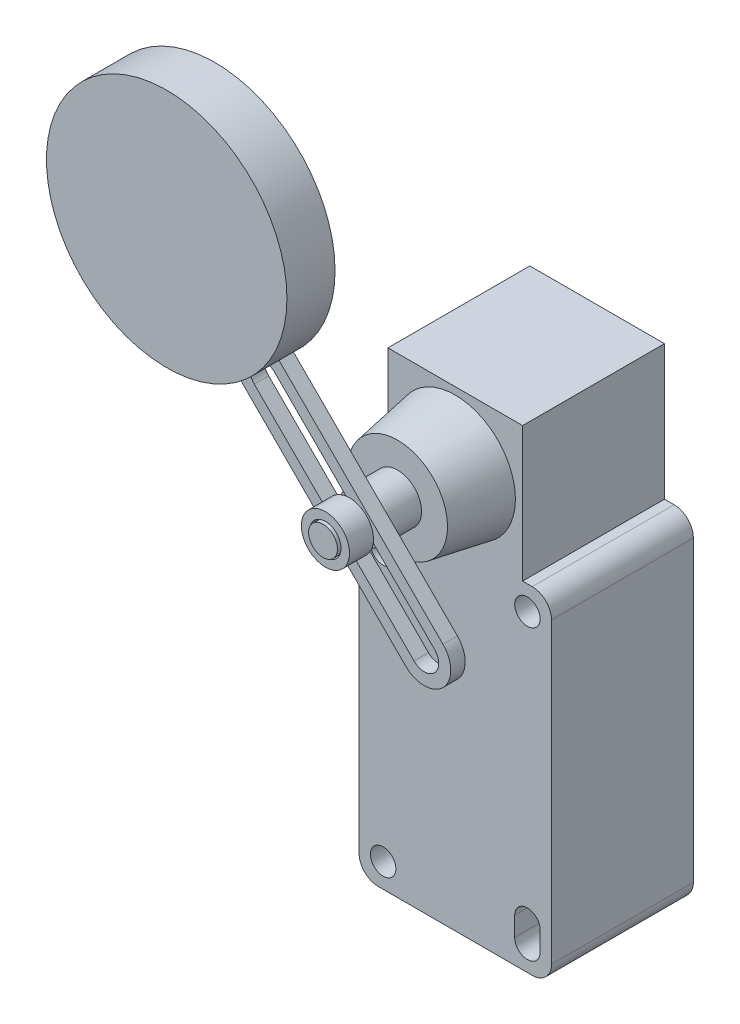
ISO-10303-21;
HEADER;
FILE_DESCRIPTION(('STEP AP214'),'2;1');
FILE_NAME('part.step','',(''),(''),'','','');
FILE_SCHEMA(('AUTOMOTIVE_DESIGN { 1 0 10303 214 1 1 1 1 }'));
ENDSEC;
DATA;
#1=APPLICATION_CONTEXT('core data for automotive mechanical design processes');
#2=APPLICATION_PROTOCOL_DEFINITION('international standard','automotive_design',2000,#1);
#3=PRODUCT_CONTEXT('',#1,'mechanical');
#4=PRODUCT('Part','Part','',(#3));
#5=PRODUCT_RELATED_PRODUCT_CATEGORY('part','',(#4));
#6=PRODUCT_DEFINITION_FORMATION('','',#4);
#7=PRODUCT_DEFINITION_CONTEXT('part definition',#1,'design');
#8=PRODUCT_DEFINITION('design','',#6,#7);
#9=PRODUCT_DEFINITION_SHAPE('','',#8);
#10=(LENGTH_UNIT() NAMED_UNIT(*) SI_UNIT(.MILLI.,.METRE.));
#11=(NAMED_UNIT(*) PLANE_ANGLE_UNIT() SI_UNIT($,.RADIAN.));
#12=(NAMED_UNIT(*) SI_UNIT($,.STERADIAN.) SOLID_ANGLE_UNIT());
#13=UNCERTAINTY_MEASURE_WITH_UNIT(LENGTH_MEASURE(1.E-05),#10,'distance_accuracy_value','');
#14=(GEOMETRIC_REPRESENTATION_CONTEXT(3) GLOBAL_UNCERTAINTY_ASSIGNED_CONTEXT((#13)) GLOBAL_UNIT_ASSIGNED_CONTEXT((#10,
#11,#12)) REPRESENTATION_CONTEXT('',''));
#15=CARTESIAN_POINT('',(0.,0.,0.));
#16=DIRECTION('',(0.,0.,1.));
#17=DIRECTION('',(1.,0.,0.));
#18=AXIS2_PLACEMENT_3D('',#15,#16,#17);
#19=CARTESIAN_POINT('',(-37.476659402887,37.4766594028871,22.));
#20=DIRECTION('',(0.,0.,1.));
#21=DIRECTION('',(1.,0.,0.));
#22=AXIS2_PLACEMENT_3D('',#19,#20,#21);
#23=PLANE('',#22);
#24=CARTESIAN_POINT('',(-37.476659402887,37.4766594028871,22.));
#25=DIRECTION('',(0.,0.,1.));
#26=DIRECTION('',(1.,0.,0.));
#27=AXIS2_PLACEMENT_3D('',#24,#25,#26);
#28=CIRCLE('',#27,5.5);
#29=CARTESIAN_POINT('',(-33.5875721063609,41.3657466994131,22.));
#30=VERTEX_POINT('',#29);
#31=CARTESIAN_POINT('',(-41.365746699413,33.5875721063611,22.));
#32=VERTEX_POINT('',#31);
#33=EDGE_CURVE('E148',#30,#32,#28,.T.);
#34=ORIENTED_EDGE('',*,*,#33,.T.);
#35=DIRECTION('',(0.707106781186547,-0.707106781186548,0.));
#36=VECTOR('',#35,1.);
#37=CARTESIAN_POINT('',(-41.365746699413,33.5875721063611,22.));
#38=LINE('',#37,#36);
#39=CARTESIAN_POINT('',(11.667261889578,-19.4454364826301,22.));
#40=VERTEX_POINT('',#39);
#41=EDGE_CURVE('E151',#32,#40,#38,.T.);
#42=ORIENTED_EDGE('',*,*,#41,.T.);
#43=CARTESIAN_POINT('',(15.556349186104,-15.5563491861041,22.));
#44=DIRECTION('',(0.,0.,1.));
#45=DIRECTION('',(1.,0.,0.));
#46=AXIS2_PLACEMENT_3D('',#43,#44,#45);
#47=CIRCLE('',#46,5.49999999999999);
#48=CARTESIAN_POINT('',(19.44543648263,-11.6672618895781,22.));
#49=VERTEX_POINT('',#48);
#50=EDGE_CURVE('E153',#40,#49,#47,.T.);
#51=ORIENTED_EDGE('',*,*,#50,.T.);
#52=DIRECTION('',(-0.707106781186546,0.707106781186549,0.));
#53=VECTOR('',#52,1.);
#54=CARTESIAN_POINT('',(-33.5875721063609,41.3657466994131,22.));
#55=LINE('',#54,#53);
#56=EDGE_CURVE('E155',#49,#30,#55,.T.);
#57=ORIENTED_EDGE('',*,*,#56,.T.);
#58=EDGE_LOOP('',(#34,#42,#51,#57));
#59=FACE_BOUND('',#58,.T.);
#60=DIRECTION('',(-0.707106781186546,0.707106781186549,0.));
#61=VECTOR('',#60,1.);
#62=CARTESIAN_POINT('',(-15.556349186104,19.7989898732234,22.));
#63=LINE('',#62,#61);
#64=CARTESIAN_POINT('',(17.6776695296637,-13.4350288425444,22.));
#65=VERTEX_POINT('',#64);
#66=CARTESIAN_POINT('',(-15.556349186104,19.7989898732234,22.));
#67=VERTEX_POINT('',#66);
#68=EDGE_CURVE('E130',#65,#67,#63,.T.);
#69=ORIENTED_EDGE('',*,*,#68,.F.);
#70=CARTESIAN_POINT('',(15.556349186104,-15.5563491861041,22.));
#71=DIRECTION('',(0.,0.,1.));
#72=DIRECTION('',(1.,0.,0.));
#73=AXIS2_PLACEMENT_3D('',#70,#71,#72);
#74=CIRCLE('',#73,3.);
#75=CARTESIAN_POINT('',(13.4350288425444,-17.6776695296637,22.));
#76=VERTEX_POINT('',#75);
#77=EDGE_CURVE('E119',#76,#65,#74,.T.);
#78=ORIENTED_EDGE('',*,*,#77,.F.);
#79=DIRECTION('',(0.707106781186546,-0.707106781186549,0.));
#80=VECTOR('',#79,1.);
#81=CARTESIAN_POINT('',(-19.7989898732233,15.5563491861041,22.));
#82=LINE('',#81,#80);
#83=CARTESIAN_POINT('',(-19.7989898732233,15.5563491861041,22.));
#84=VERTEX_POINT('',#83);
#85=EDGE_CURVE('E134',#84,#76,#82,.T.);
#86=ORIENTED_EDGE('',*,*,#85,.F.);
#87=CARTESIAN_POINT('',(-17.6776695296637,17.6776695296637,22.));
#88=DIRECTION('',(0.,0.,1.));
#89=DIRECTION('',(1.,0.,0.));
#90=AXIS2_PLACEMENT_3D('',#87,#88,#89);
#91=CIRCLE('',#90,3.);
#92=EDGE_CURVE('E132',#67,#84,#91,.T.);
#93=ORIENTED_EDGE('',*,*,#92,.F.);
#94=EDGE_LOOP('',(#69,#78,#86,#93));
#95=FACE_BOUND('',#94,.T.);
#96=ADVANCED_FACE('F39',(#59,#95),#23,.T.);
#97=CARTESIAN_POINT('',(-37.476659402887,37.4766594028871,19.));
#98=DIRECTION('',(0.,0.,1.));
#99=DIRECTION('',(1.,0.,0.));
#100=AXIS2_PLACEMENT_3D('',#97,#98,#99);
#101=PLANE('',#100);
#102=CARTESIAN_POINT('',(-37.476659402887,37.4766594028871,19.));
#103=DIRECTION('',(0.,0.,1.));
#104=DIRECTION('',(1.,0.,0.));
#105=AXIS2_PLACEMENT_3D('',#102,#103,#104);
#106=CIRCLE('',#105,5.5);
#107=CARTESIAN_POINT('',(-33.5875721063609,41.3657466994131,19.));
#108=VERTEX_POINT('',#107);
#109=CARTESIAN_POINT('',(-41.365746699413,33.5875721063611,19.));
#110=VERTEX_POINT('',#109);
#111=EDGE_CURVE('E120',#108,#110,#106,.T.);
#112=ORIENTED_EDGE('',*,*,#111,.F.);
#113=DIRECTION('',(-0.707106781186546,0.707106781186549,0.));
#114=VECTOR('',#113,1.);
#115=CARTESIAN_POINT('',(-33.5875721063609,41.3657466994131,19.));
#116=LINE('',#115,#114);
#117=CARTESIAN_POINT('',(19.44543648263,-11.6672618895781,19.));
#118=VERTEX_POINT('',#117);
#119=EDGE_CURVE('E146',#118,#108,#116,.T.);
#120=ORIENTED_EDGE('',*,*,#119,.F.);
#121=CARTESIAN_POINT('',(15.556349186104,-15.5563491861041,19.));
#122=DIRECTION('',(0.,0.,1.));
#123=DIRECTION('',(1.,0.,0.));
#124=AXIS2_PLACEMENT_3D('',#121,#122,#123);
#125=CIRCLE('',#124,5.49999999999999);
#126=CARTESIAN_POINT('',(11.667261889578,-19.4454364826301,19.));
#127=VERTEX_POINT('',#126);
#128=EDGE_CURVE('E144',#127,#118,#125,.T.);
#129=ORIENTED_EDGE('',*,*,#128,.F.);
#130=DIRECTION('',(0.707106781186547,-0.707106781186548,0.));
#131=VECTOR('',#130,1.);
#132=CARTESIAN_POINT('',(-41.365746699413,33.5875721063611,19.));
#133=LINE('',#132,#131);
#134=EDGE_CURVE('E142',#110,#127,#133,.T.);
#135=ORIENTED_EDGE('',*,*,#134,.F.);
#136=EDGE_LOOP('',(#112,#120,#129,#135));
#137=FACE_BOUND('',#136,.T.);
#138=CARTESIAN_POINT('',(15.556349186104,-15.5563491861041,19.));
#139=DIRECTION('',(0.,0.,1.));
#140=DIRECTION('',(1.,0.,0.));
#141=AXIS2_PLACEMENT_3D('',#138,#139,#140);
#142=CIRCLE('',#141,3.);
#143=CARTESIAN_POINT('',(13.4350288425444,-17.6776695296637,19.));
#144=VERTEX_POINT('',#143);
#145=CARTESIAN_POINT('',(17.6776695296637,-13.4350288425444,19.));
#146=VERTEX_POINT('',#145);
#147=EDGE_CURVE('E62',#144,#146,#142,.T.);
#148=ORIENTED_EDGE('',*,*,#147,.T.);
#149=DIRECTION('',(-0.707106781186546,0.707106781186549,0.));
#150=VECTOR('',#149,1.);
#151=CARTESIAN_POINT('',(-15.556349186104,19.7989898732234,19.));
#152=LINE('',#151,#150);
#153=CARTESIAN_POINT('',(-15.556349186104,19.7989898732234,19.));
#154=VERTEX_POINT('',#153);
#155=EDGE_CURVE('E106',#146,#154,#152,.T.);
#156=ORIENTED_EDGE('',*,*,#155,.T.);
#157=CARTESIAN_POINT('',(-17.6776695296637,17.6776695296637,19.));
#158=DIRECTION('',(0.,0.,1.));
#159=DIRECTION('',(1.,0.,0.));
#160=AXIS2_PLACEMENT_3D('',#157,#158,#159);
#161=CIRCLE('',#160,3.);
#162=CARTESIAN_POINT('',(-19.7989898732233,15.5563491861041,19.));
#163=VERTEX_POINT('',#162);
#164=EDGE_CURVE('E115',#154,#163,#161,.T.);
#165=ORIENTED_EDGE('',*,*,#164,.T.);
#166=DIRECTION('',(0.707106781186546,-0.707106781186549,0.));
#167=VECTOR('',#166,1.);
#168=CARTESIAN_POINT('',(-19.7989898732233,15.5563491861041,19.));
#169=LINE('',#168,#167);
#170=EDGE_CURVE('E124',#163,#144,#169,.T.);
#171=ORIENTED_EDGE('',*,*,#170,.T.);
#172=EDGE_LOOP('',(#148,#156,#165,#171));
#173=FACE_BOUND('',#172,.T.);
#174=ADVANCED_FACE('F123',(#137,#173),#101,.F.);
#175=CARTESIAN_POINT('',(-37.476659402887,37.4766594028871,22.));
#176=DIRECTION('',(0.,0.,-1.));
#177=DIRECTION('',(-1.,0.,0.));
#178=AXIS2_PLACEMENT_3D('',#175,#176,#177);
#179=CYLINDRICAL_SURFACE('',#178,5.5);
#180=ORIENTED_EDGE('',*,*,#111,.T.);
#181=DIRECTION('',(0.,0.,-1.));
#182=VECTOR('',#181,1.);
#183=CARTESIAN_POINT('',(-41.365746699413,33.5875721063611,22.));
#184=LINE('',#183,#182);
#185=EDGE_CURVE('E12',#32,#110,#184,.T.);
#186=ORIENTED_EDGE('',*,*,#185,.F.);
#187=ORIENTED_EDGE('',*,*,#33,.F.);
#188=DIRECTION('',(0.,0.,-1.));
#189=VECTOR('',#188,1.);
#190=CARTESIAN_POINT('',(-33.5875721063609,41.3657466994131,22.));
#191=LINE('',#190,#189);
#192=EDGE_CURVE('E157',#30,#108,#191,.T.);
#193=ORIENTED_EDGE('',*,*,#192,.T.);
#194=EDGE_LOOP('',(#180,#186,#187,#193));
#195=FACE_BOUND('',#194,.T.);
#196=ADVANCED_FACE('F41',(#195),#179,.T.);
#197=CARTESIAN_POINT('',(-41.365746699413,33.5875721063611,22.));
#198=DIRECTION('',(0.707106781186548,0.707106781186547,0.));
#199=DIRECTION('',(-0.707106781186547,0.707106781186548,0.));
#200=AXIS2_PLACEMENT_3D('',#197,#198,#199);
#201=PLANE('',#200);
#202=ORIENTED_EDGE('',*,*,#134,.T.);
#203=DIRECTION('',(0.,0.,-1.));
#204=VECTOR('',#203,1.);
#205=CARTESIAN_POINT('',(11.667261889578,-19.4454364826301,22.));
#206=LINE('',#205,#204);
#207=EDGE_CURVE('E47',#40,#127,#206,.T.);
#208=ORIENTED_EDGE('',*,*,#207,.F.);
#209=ORIENTED_EDGE('',*,*,#41,.F.);
#210=ORIENTED_EDGE('',*,*,#185,.T.);
#211=EDGE_LOOP('',(#202,#208,#209,#210));
#212=FACE_BOUND('',#211,.T.);
#213=ADVANCED_FACE('F182',(#212),#201,.F.);
#214=CARTESIAN_POINT('',(15.556349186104,-15.5563491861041,22.));
#215=DIRECTION('',(0.,0.,-1.));
#216=DIRECTION('',(-1.,0.,0.));
#217=AXIS2_PLACEMENT_3D('',#214,#215,#216);
#218=CYLINDRICAL_SURFACE('',#217,5.49999999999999);
#219=ORIENTED_EDGE('',*,*,#128,.T.);
#220=DIRECTION('',(0.,0.,-1.));
#221=VECTOR('',#220,1.);
#222=CARTESIAN_POINT('',(19.44543648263,-11.6672618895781,22.));
#223=LINE('',#222,#221);
#224=EDGE_CURVE('E160',#49,#118,#223,.T.);
#225=ORIENTED_EDGE('',*,*,#224,.F.);
#226=ORIENTED_EDGE('',*,*,#50,.F.);
#227=ORIENTED_EDGE('',*,*,#207,.T.);
#228=EDGE_LOOP('',(#219,#225,#226,#227));
#229=FACE_BOUND('',#228,.T.);
#230=ADVANCED_FACE('F167',(#229),#218,.T.);
#231=CARTESIAN_POINT('',(-33.5875721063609,41.3657466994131,22.));
#232=DIRECTION('',(-0.707106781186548,-0.707106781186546,0.));
#233=DIRECTION('',(0.707106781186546,-0.707106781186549,0.));
#234=AXIS2_PLACEMENT_3D('',#231,#232,#233);
#235=PLANE('',#234);
#236=ORIENTED_EDGE('',*,*,#119,.T.);
#237=ORIENTED_EDGE('',*,*,#192,.F.);
#238=ORIENTED_EDGE('',*,*,#56,.F.);
#239=ORIENTED_EDGE('',*,*,#224,.T.);
#240=EDGE_LOOP('',(#236,#237,#238,#239));
#241=FACE_BOUND('',#240,.T.);
#242=ADVANCED_FACE('F175',(#241),#235,.F.);
#243=CARTESIAN_POINT('',(15.556349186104,-15.5563491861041,22.));
#244=DIRECTION('',(0.,0.,-1.));
#245=DIRECTION('',(-1.,0.,0.));
#246=AXIS2_PLACEMENT_3D('',#243,#244,#245);
#247=CYLINDRICAL_SURFACE('',#246,3.);
#248=ORIENTED_EDGE('',*,*,#147,.F.);
#249=DIRECTION('',(0.,0.,-1.));
#250=VECTOR('',#249,1.);
#251=CARTESIAN_POINT('',(13.4350288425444,-17.6776695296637,22.));
#252=LINE('',#251,#250);
#253=EDGE_CURVE('E136',#76,#144,#252,.T.);
#254=ORIENTED_EDGE('',*,*,#253,.F.);
#255=ORIENTED_EDGE('',*,*,#77,.T.);
#256=DIRECTION('',(0.,0.,-1.));
#257=VECTOR('',#256,1.);
#258=CARTESIAN_POINT('',(17.6776695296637,-13.4350288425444,22.));
#259=LINE('',#258,#257);
#260=EDGE_CURVE('E108',#65,#146,#259,.T.);
#261=ORIENTED_EDGE('',*,*,#260,.T.);
#262=EDGE_LOOP('',(#248,#254,#255,#261));
#263=FACE_BOUND('',#262,.T.);
#264=ADVANCED_FACE('F117',(#263),#247,.F.);
#265=CARTESIAN_POINT('',(-15.556349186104,19.7989898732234,22.));
#266=DIRECTION('',(-0.707106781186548,-0.707106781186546,0.));
#267=DIRECTION('',(0.707106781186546,-0.707106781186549,0.));
#268=AXIS2_PLACEMENT_3D('',#265,#266,#267);
#269=PLANE('',#268);
#270=ORIENTED_EDGE('',*,*,#155,.F.);
#271=ORIENTED_EDGE('',*,*,#260,.F.);
#272=ORIENTED_EDGE('',*,*,#68,.T.);
#273=DIRECTION('',(0.,0.,-1.));
#274=VECTOR('',#273,1.);
#275=CARTESIAN_POINT('',(-15.556349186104,19.7989898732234,22.));
#276=LINE('',#275,#274);
#277=EDGE_CURVE('E111',#67,#154,#276,.T.);
#278=ORIENTED_EDGE('',*,*,#277,.T.);
#279=EDGE_LOOP('',(#270,#271,#272,#278));
#280=FACE_BOUND('',#279,.T.);
#281=ADVANCED_FACE('F107',(#280),#269,.T.);
#282=CARTESIAN_POINT('',(-17.6776695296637,17.6776695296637,22.));
#283=DIRECTION('',(0.,0.,-1.));
#284=DIRECTION('',(-1.,0.,0.));
#285=AXIS2_PLACEMENT_3D('',#282,#283,#284);
#286=CYLINDRICAL_SURFACE('',#285,3.);
#287=ORIENTED_EDGE('',*,*,#164,.F.);
#288=ORIENTED_EDGE('',*,*,#277,.F.);
#289=ORIENTED_EDGE('',*,*,#92,.T.);
#290=DIRECTION('',(0.,0.,-1.));
#291=VECTOR('',#290,1.);
#292=CARTESIAN_POINT('',(-19.7989898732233,15.5563491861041,22.));
#293=LINE('',#292,#291);
#294=EDGE_CURVE('E54',#84,#163,#293,.T.);
#295=ORIENTED_EDGE('',*,*,#294,.T.);
#296=EDGE_LOOP('',(#287,#288,#289,#295));
#297=FACE_BOUND('',#296,.T.);
#298=ADVANCED_FACE('F204',(#297),#286,.F.);
#299=CARTESIAN_POINT('',(-19.7989898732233,15.5563491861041,22.));
#300=DIRECTION('',(0.707106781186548,0.707106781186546,0.));
#301=DIRECTION('',(-0.707106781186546,0.707106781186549,0.));
#302=AXIS2_PLACEMENT_3D('',#299,#300,#301);
#303=PLANE('',#302);
#304=ORIENTED_EDGE('',*,*,#170,.F.);
#305=ORIENTED_EDGE('',*,*,#294,.F.);
#306=ORIENTED_EDGE('',*,*,#85,.T.);
#307=ORIENTED_EDGE('',*,*,#253,.T.);
#308=EDGE_LOOP('',(#304,#305,#306,#307));
#309=FACE_BOUND('',#308,.T.);
#310=ADVANCED_FACE('F209',(#309),#303,.T.);
#311=CLOSED_SHELL('',(#96,#174,#196,#213,#230,#242,#264,#281,#298,#310));
#312=MANIFOLD_SOLID_BREP('B2',#311);
#313=CARTESIAN_POINT('',(0.,0.,27.));
#314=DIRECTION('',(0.,0.,1.));
#315=DIRECTION('',(1.,0.,0.));
#316=AXIS2_PLACEMENT_3D('',#313,#314,#315);
#317=PLANE('',#316);
#318=CARTESIAN_POINT('',(0.,0.,27.));
#319=DIRECTION('',(0.,0.,1.));
#320=DIRECTION('',(1.,0.,0.));
#321=AXIS2_PLACEMENT_3D('',#318,#319,#320);
#322=CIRCLE('',#321,5.);
#323=CARTESIAN_POINT('',(5.,0.,27.));
#324=VERTEX_POINT('',#323);
#325=EDGE_CURVE('E38',#324,#324,#322,.T.);
#326=ORIENTED_EDGE('',*,*,#325,.T.);
#327=EDGE_LOOP('',(#326));
#328=FACE_BOUND('',#327,.T.);
#329=CARTESIAN_POINT('',(0.,0.,27.));
#330=DIRECTION('',(0.,0.,1.));
#331=DIRECTION('',(1.,0.,0.));
#332=AXIS2_PLACEMENT_3D('',#329,#330,#331);
#333=CIRCLE('',#332,3.25);
#334=CARTESIAN_POINT('',(3.25,0.,27.));
#335=VERTEX_POINT('',#334);
#336=EDGE_CURVE('E287',#335,#335,#333,.T.);
#337=ORIENTED_EDGE('',*,*,#336,.F.);
#338=EDGE_LOOP('',(#337));
#339=FACE_BOUND('',#338,.T.);
#340=ADVANCED_FACE('F276',(#328,#339),#317,.T.);
#341=CARTESIAN_POINT('',(0.,0.,22.));
#342=DIRECTION('',(0.,0.,1.));
#343=DIRECTION('',(1.,0.,0.));
#344=AXIS2_PLACEMENT_3D('',#341,#342,#343);
#345=PLANE('',#344);
#346=CARTESIAN_POINT('',(0.,0.,22.));
#347=DIRECTION('',(0.,0.,1.));
#348=DIRECTION('',(1.,0.,0.));
#349=AXIS2_PLACEMENT_3D('',#346,#347,#348);
#350=CIRCLE('',#349,5.);
#351=CARTESIAN_POINT('',(5.,0.,22.));
#352=VERTEX_POINT('',#351);
#353=EDGE_CURVE('E283',#352,#352,#350,.T.);
#354=ORIENTED_EDGE('',*,*,#353,.F.);
#355=EDGE_LOOP('',(#354));
#356=FACE_BOUND('',#355,.T.);
#357=CARTESIAN_POINT('',(0.,0.,22.));
#358=DIRECTION('',(0.,0.,1.));
#359=DIRECTION('',(1.,0.,0.));
#360=AXIS2_PLACEMENT_3D('',#357,#358,#359);
#361=CIRCLE('',#360,3.25);
#362=CARTESIAN_POINT('',(3.25,0.,22.));
#363=VERTEX_POINT('',#362);
#364=EDGE_CURVE('E291',#363,#363,#361,.T.);
#365=ORIENTED_EDGE('',*,*,#364,.T.);
#366=EDGE_LOOP('',(#365));
#367=FACE_BOUND('',#366,.T.);
#368=ADVANCED_FACE('F297',(#356,#367),#345,.F.);
#369=CARTESIAN_POINT('',(0.,0.,27.));
#370=DIRECTION('',(0.,0.,-1.));
#371=DIRECTION('',(-1.,0.,0.));
#372=AXIS2_PLACEMENT_3D('',#369,#370,#371);
#373=CYLINDRICAL_SURFACE('',#372,5.);
#374=ORIENTED_EDGE('',*,*,#325,.F.);
#375=EDGE_LOOP('',(#374));
#376=FACE_BOUND('',#375,.T.);
#377=ORIENTED_EDGE('',*,*,#353,.T.);
#378=EDGE_LOOP('',(#377));
#379=FACE_BOUND('',#378,.T.);
#380=ADVANCED_FACE('F278',(#376,#379),#373,.T.);
#381=CARTESIAN_POINT('',(0.,0.,27.));
#382=DIRECTION('',(0.,0.,-1.));
#383=DIRECTION('',(-1.,0.,0.));
#384=AXIS2_PLACEMENT_3D('',#381,#382,#383);
#385=CYLINDRICAL_SURFACE('',#384,3.25);
#386=ORIENTED_EDGE('',*,*,#336,.T.);
#387=EDGE_LOOP('',(#386));
#388=FACE_BOUND('',#387,.T.);
#389=ORIENTED_EDGE('',*,*,#364,.F.);
#390=EDGE_LOOP('',(#389));
#391=FACE_BOUND('',#390,.T.);
#392=ADVANCED_FACE('F299',(#388,#391),#385,.F.);
#393=CLOSED_SHELL('',(#340,#368,#380,#392));
#394=MANIFOLD_SOLID_BREP('B6',#393);
#395=CARTESIAN_POINT('',(0.,0.,19.));
#396=DIRECTION('',(0.,0.,1.));
#397=DIRECTION('',(1.,0.,0.));
#398=AXIS2_PLACEMENT_3D('',#395,#396,#397);
#399=PLANE('',#398);
#400=CARTESIAN_POINT('',(0.,0.,19.));
#401=DIRECTION('',(0.,0.,1.));
#402=DIRECTION('',(1.,0.,0.));
#403=AXIS2_PLACEMENT_3D('',#400,#401,#402);
#404=CIRCLE('',#403,5.);
#405=CARTESIAN_POINT('',(5.,0.,19.));
#406=VERTEX_POINT('',#405);
#407=EDGE_CURVE('E275',#406,#406,#404,.T.);
#408=ORIENTED_EDGE('',*,*,#407,.T.);
#409=EDGE_LOOP('',(#408));
#410=FACE_BOUND('',#409,.T.);
#411=CARTESIAN_POINT('',(0.,0.,19.));
#412=DIRECTION('',(0.,0.,1.));
#413=DIRECTION('',(1.,0.,0.));
#414=AXIS2_PLACEMENT_3D('',#411,#412,#413);
#415=CIRCLE('',#414,3.25);
#416=CARTESIAN_POINT('',(3.25,0.,19.));
#417=VERTEX_POINT('',#416);
#418=EDGE_CURVE('E356',#417,#417,#415,.T.);
#419=ORIENTED_EDGE('',*,*,#418,.F.);
#420=EDGE_LOOP('',(#419));
#421=FACE_BOUND('',#420,.T.);
#422=ADVANCED_FACE('F345',(#410,#421),#399,.T.);
#423=CARTESIAN_POINT('',(0.,0.,12.));
#424=DIRECTION('',(0.,0.,1.));
#425=DIRECTION('',(1.,0.,0.));
#426=AXIS2_PLACEMENT_3D('',#423,#424,#425);
#427=PLANE('',#426);
#428=CARTESIAN_POINT('',(0.,0.,12.));
#429=DIRECTION('',(0.,0.,1.));
#430=DIRECTION('',(1.,0.,0.));
#431=AXIS2_PLACEMENT_3D('',#428,#429,#430);
#432=CIRCLE('',#431,5.);
#433=CARTESIAN_POINT('',(5.,0.,12.));
#434=VERTEX_POINT('',#433);
#435=EDGE_CURVE('E352',#434,#434,#432,.T.);
#436=ORIENTED_EDGE('',*,*,#435,.F.);
#437=EDGE_LOOP('',(#436));
#438=FACE_BOUND('',#437,.T.);
#439=CARTESIAN_POINT('',(0.,0.,12.));
#440=DIRECTION('',(0.,0.,1.));
#441=DIRECTION('',(1.,0.,0.));
#442=AXIS2_PLACEMENT_3D('',#439,#440,#441);
#443=CIRCLE('',#442,3.25);
#444=CARTESIAN_POINT('',(3.25,0.,12.));
#445=VERTEX_POINT('',#444);
#446=EDGE_CURVE('E360',#445,#445,#443,.T.);
#447=ORIENTED_EDGE('',*,*,#446,.T.);
#448=EDGE_LOOP('',(#447));
#449=FACE_BOUND('',#448,.T.);
#450=ADVANCED_FACE('F366',(#438,#449),#427,.F.);
#451=CARTESIAN_POINT('',(0.,0.,19.));
#452=DIRECTION('',(0.,0.,-1.));
#453=DIRECTION('',(-1.,0.,0.));
#454=AXIS2_PLACEMENT_3D('',#451,#452,#453);
#455=CYLINDRICAL_SURFACE('',#454,5.);
#456=ORIENTED_EDGE('',*,*,#407,.F.);
#457=EDGE_LOOP('',(#456));
#458=FACE_BOUND('',#457,.T.);
#459=ORIENTED_EDGE('',*,*,#435,.T.);
#460=EDGE_LOOP('',(#459));
#461=FACE_BOUND('',#460,.T.);
#462=ADVANCED_FACE('F347',(#458,#461),#455,.T.);
#463=CARTESIAN_POINT('',(0.,0.,19.));
#464=DIRECTION('',(0.,0.,-1.));
#465=DIRECTION('',(-1.,0.,0.));
#466=AXIS2_PLACEMENT_3D('',#463,#464,#465);
#467=CYLINDRICAL_SURFACE('',#466,3.25);
#468=ORIENTED_EDGE('',*,*,#418,.T.);
#469=EDGE_LOOP('',(#468));
#470=FACE_BOUND('',#469,.T.);
#471=ORIENTED_EDGE('',*,*,#446,.F.);
#472=EDGE_LOOP('',(#471));
#473=FACE_BOUND('',#472,.T.);
#474=ADVANCED_FACE('F368',(#470,#473),#467,.F.);
#475=CLOSED_SHELL('',(#422,#450,#462,#474));
#476=MANIFOLD_SOLID_BREP('B33',#475);
#477=CARTESIAN_POINT('',(-26.4999999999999,45.8993464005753,22.));
#478=DIRECTION('',(0.,0.,1.));
#479=DIRECTION('',(1.,0.,0.));
#480=AXIS2_PLACEMENT_3D('',#477,#478,#479);
#481=CYLINDRICAL_SURFACE('',#480,7.5);
#482=CARTESIAN_POINT('',(-26.4999999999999,45.8993464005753,22.));
#483=DIRECTION('',(0.,0.,-1.));
#484=DIRECTION('',(-1.,0.,0.));
#485=AXIS2_PLACEMENT_3D('',#482,#483,#484);
#486=CIRCLE('',#485,7.5);
#487=CARTESIAN_POINT('',(-33.9999999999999,45.8993464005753,22.));
#488=VERTEX_POINT('',#487);
#489=EDGE_CURVE('E344',#488,#488,#486,.T.);
#490=ORIENTED_EDGE('',*,*,#489,.F.);
#491=EDGE_LOOP('',(#490));
#492=FACE_BOUND('',#491,.T.);
#493=CARTESIAN_POINT('',(-26.4999999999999,45.8993464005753,23.5));
#494=DIRECTION('',(0.,0.,-1.));
#495=DIRECTION('',(-1.,0.,0.));
#496=AXIS2_PLACEMENT_3D('',#493,#494,#495);
#497=CIRCLE('',#496,7.5);
#498=CARTESIAN_POINT('',(-33.9999999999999,45.8993464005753,23.5));
#499=VERTEX_POINT('',#498);
#500=EDGE_CURVE('E420',#499,#499,#497,.T.);
#501=ORIENTED_EDGE('',*,*,#500,.T.);
#502=EDGE_LOOP('',(#501));
#503=FACE_BOUND('',#502,.T.);
#504=ADVANCED_FACE('F414',(#492,#503),#481,.T.);
#505=CARTESIAN_POINT('',(-26.4999999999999,45.8993464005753,22.));
#506=DIRECTION('',(0.,0.,-1.));
#507=DIRECTION('',(-1.,0.,0.));
#508=AXIS2_PLACEMENT_3D('',#505,#506,#507);
#509=PLANE('',#508);
#510=ORIENTED_EDGE('',*,*,#489,.T.);
#511=EDGE_LOOP('',(#510));
#512=FACE_BOUND('',#511,.T.);
#513=ADVANCED_FACE('F429',(#512),#509,.T.);
#514=CARTESIAN_POINT('',(-26.4999999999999,45.8993464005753,23.5));
#515=DIRECTION('',(0.,0.,-1.));
#516=DIRECTION('',(-1.,0.,0.));
#517=AXIS2_PLACEMENT_3D('',#514,#515,#516);
#518=PLANE('',#517);
#519=ORIENTED_EDGE('',*,*,#500,.F.);
#520=EDGE_LOOP('',(#519));
#521=FACE_BOUND('',#520,.T.);
#522=ADVANCED_FACE('F427',(#521),#518,.F.);
#523=CLOSED_SHELL('',(#504,#513,#522));
#524=MANIFOLD_SOLID_BREP('B270',#523);
#525=CARTESIAN_POINT('',(-26.4999999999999,45.8993464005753,33.5));
#526=DIRECTION('',(0.,0.,-1.));
#527=DIRECTION('',(-1.,0.,0.));
#528=AXIS2_PLACEMENT_3D('',#525,#526,#527);
#529=CYLINDRICAL_SURFACE('',#528,25.);
#530=CARTESIAN_POINT('',(-26.4999999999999,45.8993464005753,33.5));
#531=DIRECTION('',(0.,0.,1.));
#532=DIRECTION('',(1.,0.,0.));
#533=AXIS2_PLACEMENT_3D('',#530,#531,#532);
#534=CIRCLE('',#533,25.);
#535=CARTESIAN_POINT('',(-1.49999999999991,45.8993464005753,33.5));
#536=VERTEX_POINT('',#535);
#537=EDGE_CURVE('E413',#536,#536,#534,.T.);
#538=ORIENTED_EDGE('',*,*,#537,.F.);
#539=EDGE_LOOP('',(#538));
#540=FACE_BOUND('',#539,.T.);
#541=CARTESIAN_POINT('',(-26.4999999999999,45.8993464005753,23.5));
#542=DIRECTION('',(0.,0.,1.));
#543=DIRECTION('',(1.,0.,0.));
#544=AXIS2_PLACEMENT_3D('',#541,#542,#543);
#545=CIRCLE('',#544,25.);
#546=CARTESIAN_POINT('',(-1.49999999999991,45.8993464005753,23.5));
#547=VERTEX_POINT('',#546);
#548=EDGE_CURVE('E469',#547,#547,#545,.T.);
#549=ORIENTED_EDGE('',*,*,#548,.T.);
#550=EDGE_LOOP('',(#549));
#551=FACE_BOUND('',#550,.T.);
#552=ADVANCED_FACE('F463',(#540,#551),#529,.T.);
#553=CARTESIAN_POINT('',(-26.4999999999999,45.8993464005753,33.5));
#554=DIRECTION('',(0.,0.,1.));
#555=DIRECTION('',(1.,0.,0.));
#556=AXIS2_PLACEMENT_3D('',#553,#554,#555);
#557=PLANE('',#556);
#558=ORIENTED_EDGE('',*,*,#537,.T.);
#559=EDGE_LOOP('',(#558));
#560=FACE_BOUND('',#559,.T.);
#561=ADVANCED_FACE('F478',(#560),#557,.T.);
#562=CARTESIAN_POINT('',(-26.4999999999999,45.8993464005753,23.5));
#563=DIRECTION('',(0.,0.,1.));
#564=DIRECTION('',(1.,0.,0.));
#565=AXIS2_PLACEMENT_3D('',#562,#563,#564);
#566=PLANE('',#565);
#567=ORIENTED_EDGE('',*,*,#548,.F.);
#568=EDGE_LOOP('',(#567));
#569=FACE_BOUND('',#568,.T.);
#570=ADVANCED_FACE('F476',(#569),#566,.F.);
#571=CLOSED_SHELL('',(#552,#561,#570));
#572=MANIFOLD_SOLID_BREP('B339',#571);
#573=CARTESIAN_POINT('',(-20.,-14.,-29.5));
#574=DIRECTION('',(-1.,0.,0.));
#575=DIRECTION('',(0.,-1.,0.));
#576=AXIS2_PLACEMENT_3D('',#573,#574,#575);
#577=PLANE('',#576);
#578=DIRECTION('',(0.,-1.,0.));
#579=VECTOR('',#578,1.);
#580=CARTESIAN_POINT('',(-20.,-14.,-29.5));
#581=LINE('',#580,#579);
#582=CARTESIAN_POINT('',(-20.,-18.,-29.5));
#583=VERTEX_POINT('',#582);
#584=CARTESIAN_POINT('',(-20.,-80.,-29.5));
#585=VERTEX_POINT('',#584);
#586=EDGE_CURVE('E751',#583,#585,#581,.T.);
#587=ORIENTED_EDGE('',*,*,#586,.T.);
#588=DIRECTION('',(0.,0.,1.));
#589=VECTOR('',#588,1.);
#590=CARTESIAN_POINT('',(-20.,-80.,-29.5));
#591=LINE('',#590,#589);
#592=CARTESIAN_POINT('',(-20.,-80.,0.));
#593=VERTEX_POINT('',#592);
#594=EDGE_CURVE('E809',#585,#593,#591,.T.);
#595=ORIENTED_EDGE('',*,*,#594,.T.);
#596=DIRECTION('',(0.,-1.,0.));
#597=VECTOR('',#596,1.);
#598=CARTESIAN_POINT('',(-20.,-14.,0.));
#599=LINE('',#598,#597);
#600=CARTESIAN_POINT('',(-20.,-18.,0.));
#601=VERTEX_POINT('',#600);
#602=EDGE_CURVE('E728',#601,#593,#599,.T.);
#603=ORIENTED_EDGE('',*,*,#602,.F.);
#604=DIRECTION('',(0.,0.,1.));
#605=VECTOR('',#604,1.);
#606=CARTESIAN_POINT('',(-20.,-18.,-29.5));
#607=LINE('',#606,#605);
#608=EDGE_CURVE('E807',#601,#583,#607,.F.);
#609=ORIENTED_EDGE('',*,*,#608,.T.);
#610=EDGE_LOOP('',(#587,#595,#603,#609));
#611=FACE_BOUND('',#610,.T.);
#612=ADVANCED_FACE('F503',(#611),#577,.T.);
#613=CARTESIAN_POINT('',(-20.,-14.,-29.5));
#614=DIRECTION('',(0.,1.,0.));
#615=DIRECTION('',(0.,0.,1.));
#616=AXIS2_PLACEMENT_3D('',#613,#614,#615);
#617=PLANE('',#616);
#618=DIRECTION('',(-1.,0.,0.));
#619=VECTOR('',#618,1.);
#620=CARTESIAN_POINT('',(-20.,-14.,-29.5));
#621=LINE('',#620,#619);
#622=CARTESIAN_POINT('',(-14.,-14.,-29.5));
#623=VERTEX_POINT('',#622);
#624=CARTESIAN_POINT('',(-16.,-14.,-29.5));
#625=VERTEX_POINT('',#624);
#626=EDGE_CURVE('E771',#623,#625,#621,.T.);
#627=ORIENTED_EDGE('',*,*,#626,.T.);
#628=DIRECTION('',(0.,0.,1.));
#629=VECTOR('',#628,1.);
#630=CARTESIAN_POINT('',(-16.,-14.,-29.5));
#631=LINE('',#630,#629);
#632=CARTESIAN_POINT('',(-16.,-14.,0.));
#633=VERTEX_POINT('',#632);
#634=EDGE_CURVE('E812',#625,#633,#631,.T.);
#635=ORIENTED_EDGE('',*,*,#634,.T.);
#636=DIRECTION('',(-1.,0.,0.));
#637=VECTOR('',#636,1.);
#638=CARTESIAN_POINT('',(-20.,-14.,0.));
#639=LINE('',#638,#637);
#640=CARTESIAN_POINT('',(-14.,-14.,0.));
#641=VERTEX_POINT('',#640);
#642=EDGE_CURVE('E748',#641,#633,#639,.T.);
#643=ORIENTED_EDGE('',*,*,#642,.F.);
#644=DIRECTION('',(0.,0.,1.));
#645=VECTOR('',#644,1.);
#646=CARTESIAN_POINT('',(-14.,-14.,-29.5));
#647=LINE('',#646,#645);
#648=EDGE_CURVE('E774',#623,#641,#647,.T.);
#649=ORIENTED_EDGE('',*,*,#648,.F.);
#650=EDGE_LOOP('',(#627,#635,#643,#649));
#651=FACE_BOUND('',#650,.T.);
#652=ADVANCED_FACE('F817',(#651),#617,.T.);
#653=CARTESIAN_POINT('',(-14.,-14.,-29.5));
#654=DIRECTION('',(-1.,0.,0.));
#655=DIRECTION('',(0.,0.,1.));
#656=AXIS2_PLACEMENT_3D('',#653,#654,#655);
#657=PLANE('',#656);
#658=DIRECTION('',(0.,-1.,0.));
#659=VECTOR('',#658,1.);
#660=CARTESIAN_POINT('',(-14.,-14.,0.));
#661=LINE('',#660,#659);
#662=CARTESIAN_POINT('',(-14.,14.,0.));
#663=VERTEX_POINT('',#662);
#664=EDGE_CURVE('E745',#663,#641,#661,.T.);
#665=ORIENTED_EDGE('',*,*,#664,.F.);
#666=DIRECTION('',(0.,0.,1.));
#667=VECTOR('',#666,1.);
#668=CARTESIAN_POINT('',(-14.,14.,-29.5));
#669=LINE('',#668,#667);
#670=CARTESIAN_POINT('',(-14.,14.,-29.5));
#671=VERTEX_POINT('',#670);
#672=EDGE_CURVE('E777',#671,#663,#669,.T.);
#673=ORIENTED_EDGE('',*,*,#672,.F.);
#674=DIRECTION('',(0.,-1.,0.));
#675=VECTOR('',#674,1.);
#676=CARTESIAN_POINT('',(-14.,-14.,-29.5));
#677=LINE('',#676,#675);
#678=EDGE_CURVE('E768',#671,#623,#677,.T.);
#679=ORIENTED_EDGE('',*,*,#678,.T.);
#680=ORIENTED_EDGE('',*,*,#648,.T.);
#681=EDGE_LOOP('',(#665,#673,#679,#680));
#682=FACE_BOUND('',#681,.T.);
#683=ADVANCED_FACE('F824',(#682),#657,.T.);
#684=CARTESIAN_POINT('',(-14.,14.,-29.5));
#685=DIRECTION('',(0.,1.,0.));
#686=DIRECTION('',(0.,0.,1.));
#687=AXIS2_PLACEMENT_3D('',#684,#685,#686);
#688=PLANE('',#687);
#689=DIRECTION('',(-1.,0.,0.));
#690=VECTOR('',#689,1.);
#691=CARTESIAN_POINT('',(-14.,14.,0.));
#692=LINE('',#691,#690);
#693=CARTESIAN_POINT('',(14.,14.,0.));
#694=VERTEX_POINT('',#693);
#695=EDGE_CURVE('E742',#694,#663,#692,.T.);
#696=ORIENTED_EDGE('',*,*,#695,.F.);
#697=DIRECTION('',(0.,0.,1.));
#698=VECTOR('',#697,1.);
#699=CARTESIAN_POINT('',(14.,14.,-29.5));
#700=LINE('',#699,#698);
#701=CARTESIAN_POINT('',(14.,14.,-29.5));
#702=VERTEX_POINT('',#701);
#703=EDGE_CURVE('E779',#702,#694,#700,.T.);
#704=ORIENTED_EDGE('',*,*,#703,.F.);
#705=DIRECTION('',(-1.,0.,0.));
#706=VECTOR('',#705,1.);
#707=CARTESIAN_POINT('',(-14.,14.,-29.5));
#708=LINE('',#707,#706);
#709=EDGE_CURVE('E765',#702,#671,#708,.T.);
#710=ORIENTED_EDGE('',*,*,#709,.T.);
#711=ORIENTED_EDGE('',*,*,#672,.T.);
#712=EDGE_LOOP('',(#696,#704,#710,#711));
#713=FACE_BOUND('',#712,.T.);
#714=ADVANCED_FACE('F875',(#713),#688,.T.);
#715=CARTESIAN_POINT('',(14.,14.,-29.5));
#716=DIRECTION('',(1.,0.,0.));
#717=DIRECTION('',(0.,1.,0.));
#718=AXIS2_PLACEMENT_3D('',#715,#716,#717);
#719=PLANE('',#718);
#720=DIRECTION('',(0.,1.,0.));
#721=VECTOR('',#720,1.);
#722=CARTESIAN_POINT('',(14.,14.,0.));
#723=LINE('',#722,#721);
#724=CARTESIAN_POINT('',(14.,-14.,0.));
#725=VERTEX_POINT('',#724);
#726=EDGE_CURVE('E739',#725,#694,#723,.T.);
#727=ORIENTED_EDGE('',*,*,#726,.F.);
#728=DIRECTION('',(0.,0.,1.));
#729=VECTOR('',#728,1.);
#730=CARTESIAN_POINT('',(14.,-14.,-29.5));
#731=LINE('',#730,#729);
#732=CARTESIAN_POINT('',(14.,-14.,-29.5));
#733=VERTEX_POINT('',#732);
#734=EDGE_CURVE('E773',#733,#725,#731,.T.);
#735=ORIENTED_EDGE('',*,*,#734,.F.);
#736=DIRECTION('',(0.,1.,0.));
#737=VECTOR('',#736,1.);
#738=CARTESIAN_POINT('',(14.,14.,-29.5));
#739=LINE('',#738,#737);
#740=EDGE_CURVE('E762',#733,#702,#739,.T.);
#741=ORIENTED_EDGE('',*,*,#740,.T.);
#742=ORIENTED_EDGE('',*,*,#703,.T.);
#743=EDGE_LOOP('',(#727,#735,#741,#742));
#744=FACE_BOUND('',#743,.T.);
#745=ADVANCED_FACE('F873',(#744),#719,.T.);
#746=CARTESIAN_POINT('',(14.,-14.,-29.5));
#747=DIRECTION('',(0.,1.,0.));
#748=DIRECTION('',(-1.,0.,0.));
#749=AXIS2_PLACEMENT_3D('',#746,#747,#748);
#750=PLANE('',#749);
#751=DIRECTION('',(-1.,0.,0.));
#752=VECTOR('',#751,1.);
#753=CARTESIAN_POINT('',(14.,-14.,0.));
#754=LINE('',#753,#752);
#755=CARTESIAN_POINT('',(16.,-14.,0.));
#756=VERTEX_POINT('',#755);
#757=EDGE_CURVE('E737',#756,#725,#754,.T.);
#758=ORIENTED_EDGE('',*,*,#757,.F.);
#759=DIRECTION('',(0.,0.,1.));
#760=VECTOR('',#759,1.);
#761=CARTESIAN_POINT('',(16.,-14.,-29.5));
#762=LINE('',#761,#760);
#763=CARTESIAN_POINT('',(16.,-14.,-29.5));
#764=VERTEX_POINT('',#763);
#765=EDGE_CURVE('E510',#756,#764,#762,.F.);
#766=ORIENTED_EDGE('',*,*,#765,.T.);
#767=DIRECTION('',(-1.,0.,0.));
#768=VECTOR('',#767,1.);
#769=CARTESIAN_POINT('',(14.,-14.,-29.5));
#770=LINE('',#769,#768);
#771=EDGE_CURVE('E760',#764,#733,#770,.T.);
#772=ORIENTED_EDGE('',*,*,#771,.T.);
#773=ORIENTED_EDGE('',*,*,#734,.T.);
#774=EDGE_LOOP('',(#758,#766,#772,#773));
#775=FACE_BOUND('',#774,.T.);
#776=ADVANCED_FACE('F868',(#775),#750,.T.);
#777=CARTESIAN_POINT('',(20.,-14.,-29.5));
#778=DIRECTION('',(1.,0.,0.));
#779=DIRECTION('',(0.,1.,0.));
#780=AXIS2_PLACEMENT_3D('',#777,#778,#779);
#781=PLANE('',#780);
#782=DIRECTION('',(0.,1.,0.));
#783=VECTOR('',#782,1.);
#784=CARTESIAN_POINT('',(20.,-14.,0.));
#785=LINE('',#784,#783);
#786=CARTESIAN_POINT('',(20.,-80.,0.));
#787=VERTEX_POINT('',#786);
#788=CARTESIAN_POINT('',(20.,-18.,0.));
#789=VERTEX_POINT('',#788);
#790=EDGE_CURVE('E734',#787,#789,#785,.T.);
#791=ORIENTED_EDGE('',*,*,#790,.F.);
#792=DIRECTION('',(0.,0.,1.));
#793=VECTOR('',#792,1.);
#794=CARTESIAN_POINT('',(20.,-80.,-29.5));
#795=LINE('',#794,#793);
#796=CARTESIAN_POINT('',(20.,-80.,-29.5));
#797=VERTEX_POINT('',#796);
#798=EDGE_CURVE('E798',#787,#797,#795,.F.);
#799=ORIENTED_EDGE('',*,*,#798,.T.);
#800=DIRECTION('',(0.,1.,0.));
#801=VECTOR('',#800,1.);
#802=CARTESIAN_POINT('',(20.,-14.,-29.5));
#803=LINE('',#802,#801);
#804=CARTESIAN_POINT('',(20.,-18.,-29.5));
#805=VERTEX_POINT('',#804);
#806=EDGE_CURVE('E757',#797,#805,#803,.T.);
#807=ORIENTED_EDGE('',*,*,#806,.T.);
#808=DIRECTION('',(0.,0.,1.));
#809=VECTOR('',#808,1.);
#810=CARTESIAN_POINT('',(20.,-18.,-29.5));
#811=LINE('',#810,#809);
#812=EDGE_CURVE('E795',#805,#789,#811,.T.);
#813=ORIENTED_EDGE('',*,*,#812,.T.);
#814=EDGE_LOOP('',(#791,#799,#807,#813));
#815=FACE_BOUND('',#814,.T.);
#816=ADVANCED_FACE('F841',(#815),#781,.T.);
#817=CARTESIAN_POINT('',(-20.,-84.,-29.5));
#818=DIRECTION('',(0.,-1.,0.));
#819=DIRECTION('',(0.,0.,-1.));
#820=AXIS2_PLACEMENT_3D('',#817,#818,#819);
#821=PLANE('',#820);
#822=DIRECTION('',(1.,0.,0.));
#823=VECTOR('',#822,1.);
#824=CARTESIAN_POINT('',(-20.,-84.,-29.5));
#825=LINE('',#824,#823);
#826=CARTESIAN_POINT('',(-16.,-84.,-29.5));
#827=VERTEX_POINT('',#826);
#828=CARTESIAN_POINT('',(16.,-84.,-29.5));
#829=VERTEX_POINT('',#828);
#830=EDGE_CURVE('E754',#827,#829,#825,.T.);
#831=ORIENTED_EDGE('',*,*,#830,.T.);
#832=DIRECTION('',(0.,0.,1.));
#833=VECTOR('',#832,1.);
#834=CARTESIAN_POINT('',(16.,-84.,-29.5));
#835=LINE('',#834,#833);
#836=CARTESIAN_POINT('',(16.,-84.,0.));
#837=VERTEX_POINT('',#836);
#838=EDGE_CURVE('E784',#829,#837,#835,.T.);
#839=ORIENTED_EDGE('',*,*,#838,.T.);
#840=DIRECTION('',(1.,0.,0.));
#841=VECTOR('',#840,1.);
#842=CARTESIAN_POINT('',(-20.,-84.,0.));
#843=LINE('',#842,#841);
#844=CARTESIAN_POINT('',(-16.,-84.,0.));
#845=VERTEX_POINT('',#844);
#846=EDGE_CURVE('E731',#845,#837,#843,.T.);
#847=ORIENTED_EDGE('',*,*,#846,.F.);
#848=DIRECTION('',(0.,0.,1.));
#849=VECTOR('',#848,1.);
#850=CARTESIAN_POINT('',(-16.,-84.,-29.5));
#851=LINE('',#850,#849);
#852=EDGE_CURVE('E776',#845,#827,#851,.F.);
#853=ORIENTED_EDGE('',*,*,#852,.T.);
#854=EDGE_LOOP('',(#831,#839,#847,#853));
#855=FACE_BOUND('',#854,.T.);
#856=ADVANCED_FACE('F831',(#855),#821,.T.);
#857=CARTESIAN_POINT('',(-20.,-84.,-29.5));
#858=DIRECTION('',(0.,0.,1.));
#859=DIRECTION('',(1.,0.,0.));
#860=AXIS2_PLACEMENT_3D('',#857,#858,#859);
#861=PLANE('',#860);
#862=DIRECTION('',(0.,1.,0.));
#863=VECTOR('',#862,1.);
#864=CARTESIAN_POINT('',(17.65,-75.,-29.5));
#865=LINE('',#864,#863);
#866=CARTESIAN_POINT('',(17.65,-79.,-29.5));
#867=VERTEX_POINT('',#866);
#868=CARTESIAN_POINT('',(17.65,-75.,-29.5));
#869=VERTEX_POINT('',#868);
#870=EDGE_CURVE('E677',#867,#869,#865,.T.);
#871=ORIENTED_EDGE('',*,*,#870,.T.);
#872=CARTESIAN_POINT('',(15.,-75.,-29.5));
#873=DIRECTION('',(0.,0.,1.));
#874=DIRECTION('',(1.,0.,0.));
#875=AXIS2_PLACEMENT_3D('',#872,#873,#874);
#876=CIRCLE('',#875,2.65);
#877=CARTESIAN_POINT('',(12.35,-75.,-29.5));
#878=VERTEX_POINT('',#877);
#879=EDGE_CURVE('E668',#869,#878,#876,.T.);
#880=ORIENTED_EDGE('',*,*,#879,.T.);
#881=DIRECTION('',(0.,-1.,0.));
#882=VECTOR('',#881,1.);
#883=CARTESIAN_POINT('',(12.35,-75.,-29.5));
#884=LINE('',#883,#882);
#885=CARTESIAN_POINT('',(12.35,-79.,-29.5));
#886=VERTEX_POINT('',#885);
#887=EDGE_CURVE('E674',#878,#886,#884,.T.);
#888=ORIENTED_EDGE('',*,*,#887,.T.);
#889=CARTESIAN_POINT('',(15.,-79.,-29.5));
#890=DIRECTION('',(0.,0.,1.));
#891=DIRECTION('',(1.,0.,0.));
#892=AXIS2_PLACEMENT_3D('',#889,#890,#891);
#893=CIRCLE('',#892,2.65);
#894=EDGE_CURVE('E648',#886,#867,#893,.T.);
#895=ORIENTED_EDGE('',*,*,#894,.T.);
#896=EDGE_LOOP('',(#871,#880,#888,#895));
#897=FACE_BOUND('',#896,.T.);
#898=DIRECTION('',(0.,-1.,0.));
#899=VECTOR('',#898,1.);
#900=CARTESIAN_POINT('',(-17.65,-19.,-29.5));
#901=LINE('',#900,#899);
#902=CARTESIAN_POINT('',(-17.65,-19.,-29.5));
#903=VERTEX_POINT('',#902);
#904=CARTESIAN_POINT('',(-17.65,-23.,-29.5));
#905=VERTEX_POINT('',#904);
#906=EDGE_CURVE('E704',#903,#905,#901,.T.);
#907=ORIENTED_EDGE('',*,*,#906,.T.);
#908=CARTESIAN_POINT('',(-15.,-23.,-29.5));
#909=DIRECTION('',(0.,0.,1.));
#910=DIRECTION('',(1.,0.,0.));
#911=AXIS2_PLACEMENT_3D('',#908,#909,#910);
#912=CIRCLE('',#911,2.65);
#913=CARTESIAN_POINT('',(-12.35,-23.,-29.5));
#914=VERTEX_POINT('',#913);
#915=EDGE_CURVE('E695',#905,#914,#912,.T.);
#916=ORIENTED_EDGE('',*,*,#915,.T.);
#917=DIRECTION('',(0.,1.,0.));
#918=VECTOR('',#917,1.);
#919=CARTESIAN_POINT('',(-12.35,-19.,-29.5));
#920=LINE('',#919,#918);
#921=CARTESIAN_POINT('',(-12.35,-19.,-29.5));
#922=VERTEX_POINT('',#921);
#923=EDGE_CURVE('E698',#914,#922,#920,.T.);
#924=ORIENTED_EDGE('',*,*,#923,.T.);
#925=CARTESIAN_POINT('',(-15.,-19.,-29.5));
#926=DIRECTION('',(0.,0.,1.));
#927=DIRECTION('',(1.,0.,0.));
#928=AXIS2_PLACEMENT_3D('',#925,#926,#927);
#929=CIRCLE('',#928,2.65);
#930=EDGE_CURVE('E701',#922,#903,#929,.T.);
#931=ORIENTED_EDGE('',*,*,#930,.T.);
#932=EDGE_LOOP('',(#907,#916,#924,#931));
#933=FACE_BOUND('',#932,.T.);
#934=CARTESIAN_POINT('',(-15.,-79.,-29.5));
#935=DIRECTION('',(0.,0.,1.));
#936=DIRECTION('',(1.,0.,0.));
#937=AXIS2_PLACEMENT_3D('',#934,#935,#936);
#938=CIRCLE('',#937,2.65);
#939=CARTESIAN_POINT('',(-12.35,-79.,-29.5));
#940=VERTEX_POINT('',#939);
#941=EDGE_CURVE('E719',#940,#940,#938,.T.);
#942=ORIENTED_EDGE('',*,*,#941,.T.);
#943=EDGE_LOOP('',(#942));
#944=FACE_BOUND('',#943,.T.);
#945=CARTESIAN_POINT('',(15.,-19.,-29.5));
#946=DIRECTION('',(0.,0.,1.));
#947=DIRECTION('',(1.,0.,0.));
#948=AXIS2_PLACEMENT_3D('',#945,#946,#947);
#949=CIRCLE('',#948,2.65);
#950=CARTESIAN_POINT('',(17.65,-19.,-29.5));
#951=VERTEX_POINT('',#950);
#952=EDGE_CURVE('E725',#951,#951,#949,.T.);
#953=ORIENTED_EDGE('',*,*,#952,.T.);
#954=EDGE_LOOP('',(#953));
#955=FACE_BOUND('',#954,.T.);
#956=ORIENTED_EDGE('',*,*,#806,.F.);
#957=CARTESIAN_POINT('',(16.,-80.,-29.5));
#958=DIRECTION('',(0.,0.,1.));
#959=DIRECTION('',(1.,0.,0.));
#960=AXIS2_PLACEMENT_3D('',#957,#958,#959);
#961=CIRCLE('',#960,4.);
#962=EDGE_CURVE('E805',#797,#829,#961,.F.);
#963=ORIENTED_EDGE('',*,*,#962,.T.);
#964=ORIENTED_EDGE('',*,*,#830,.F.);
#965=CARTESIAN_POINT('',(-16.,-80.,-29.5));
#966=DIRECTION('',(0.,0.,1.));
#967=DIRECTION('',(1.,0.,0.));
#968=AXIS2_PLACEMENT_3D('',#965,#966,#967);
#969=CIRCLE('',#968,4.);
#970=EDGE_CURVE('E803',#827,#585,#969,.F.);
#971=ORIENTED_EDGE('',*,*,#970,.T.);
#972=ORIENTED_EDGE('',*,*,#586,.F.);
#973=CARTESIAN_POINT('',(-16.,-18.,-29.5));
#974=DIRECTION('',(0.,0.,1.));
#975=DIRECTION('',(1.,0.,0.));
#976=AXIS2_PLACEMENT_3D('',#973,#974,#975);
#977=CIRCLE('',#976,4.);
#978=EDGE_CURVE('E524',#583,#625,#977,.F.);
#979=ORIENTED_EDGE('',*,*,#978,.T.);
#980=ORIENTED_EDGE('',*,*,#626,.F.);
#981=ORIENTED_EDGE('',*,*,#678,.F.);
#982=ORIENTED_EDGE('',*,*,#709,.F.);
#983=ORIENTED_EDGE('',*,*,#740,.F.);
#984=ORIENTED_EDGE('',*,*,#771,.F.);
#985=CARTESIAN_POINT('',(16.,-18.,-29.5));
#986=DIRECTION('',(0.,0.,1.));
#987=DIRECTION('',(1.,0.,0.));
#988=AXIS2_PLACEMENT_3D('',#985,#986,#987);
#989=CIRCLE('',#988,4.);
#990=EDGE_CURVE('E800',#764,#805,#989,.F.);
#991=ORIENTED_EDGE('',*,*,#990,.T.);
#992=EDGE_LOOP('',(#956,#963,#964,#971,#972,#979,#980,#981,#982,#983,#984,#991));
#993=FACE_BOUND('',#992,.T.);
#994=ADVANCED_FACE('F828',(#897,#933,#944,#955,#993),#861,.F.);
#995=CARTESIAN_POINT('',(-20.,-84.,0.));
#996=DIRECTION('',(0.,0.,1.));
#997=DIRECTION('',(1.,0.,0.));
#998=AXIS2_PLACEMENT_3D('',#995,#996,#997);
#999=PLANE('',#998);
#1000=CARTESIAN_POINT('',(0.,0.,0.));
#1001=DIRECTION('',(0.,0.,1.));
#1002=DIRECTION('',(1.,0.,0.));
#1003=AXIS2_PLACEMENT_3D('',#1000,#1001,#1002);
#1004=CIRCLE('',#1003,12.5);
#1005=CARTESIAN_POINT('',(12.5,0.,0.));
#1006=VERTEX_POINT('',#1005);
#1007=EDGE_CURVE('E461',#1006,#1006,#1004,.T.);
#1008=ORIENTED_EDGE('',*,*,#1007,.F.);
#1009=EDGE_LOOP('',(#1008));
#1010=FACE_BOUND('',#1009,.T.);
#1011=CARTESIAN_POINT('',(15.,-75.,0.));
#1012=DIRECTION('',(0.,0.,1.));
#1013=DIRECTION('',(1.,0.,0.));
#1014=AXIS2_PLACEMENT_3D('',#1011,#1012,#1013);
#1015=CIRCLE('',#1014,2.65);
#1016=CARTESIAN_POINT('',(17.65,-75.,0.));
#1017=VERTEX_POINT('',#1016);
#1018=CARTESIAN_POINT('',(12.35,-75.,0.));
#1019=VERTEX_POINT('',#1018);
#1020=EDGE_CURVE('E661',#1017,#1019,#1015,.T.);
#1021=ORIENTED_EDGE('',*,*,#1020,.F.);
#1022=DIRECTION('',(0.,1.,0.));
#1023=VECTOR('',#1022,1.);
#1024=CARTESIAN_POINT('',(17.65,-75.,0.));
#1025=LINE('',#1024,#1023);
#1026=CARTESIAN_POINT('',(17.65,-79.,0.));
#1027=VERTEX_POINT('',#1026);
#1028=EDGE_CURVE('E666',#1027,#1017,#1025,.T.);
#1029=ORIENTED_EDGE('',*,*,#1028,.F.);
#1030=CARTESIAN_POINT('',(15.,-79.,0.));
#1031=DIRECTION('',(0.,0.,1.));
#1032=DIRECTION('',(1.,0.,0.));
#1033=AXIS2_PLACEMENT_3D('',#1030,#1031,#1032);
#1034=CIRCLE('',#1033,2.65);
#1035=CARTESIAN_POINT('',(12.35,-79.,0.));
#1036=VERTEX_POINT('',#1035);
#1037=EDGE_CURVE('E645',#1036,#1027,#1034,.T.);
#1038=ORIENTED_EDGE('',*,*,#1037,.F.);
#1039=DIRECTION('',(0.,-1.,0.));
#1040=VECTOR('',#1039,1.);
#1041=CARTESIAN_POINT('',(12.35,-75.,0.));
#1042=LINE('',#1041,#1040);
#1043=EDGE_CURVE('E657',#1019,#1036,#1042,.T.);
#1044=ORIENTED_EDGE('',*,*,#1043,.F.);
#1045=EDGE_LOOP('',(#1021,#1029,#1038,#1044));
#1046=FACE_BOUND('',#1045,.T.);
#1047=CARTESIAN_POINT('',(-15.,-23.,0.));
#1048=DIRECTION('',(0.,0.,1.));
#1049=DIRECTION('',(1.,0.,0.));
#1050=AXIS2_PLACEMENT_3D('',#1047,#1048,#1049);
#1051=CIRCLE('',#1050,2.65);
#1052=CARTESIAN_POINT('',(-17.65,-23.,0.));
#1053=VERTEX_POINT('',#1052);
#1054=CARTESIAN_POINT('',(-12.35,-23.,0.));
#1055=VERTEX_POINT('',#1054);
#1056=EDGE_CURVE('E682',#1053,#1055,#1051,.T.);
#1057=ORIENTED_EDGE('',*,*,#1056,.F.);
#1058=DIRECTION('',(0.,-1.,0.));
#1059=VECTOR('',#1058,1.);
#1060=CARTESIAN_POINT('',(-17.65,-19.,0.));
#1061=LINE('',#1060,#1059);
#1062=CARTESIAN_POINT('',(-17.65,-19.,0.));
#1063=VERTEX_POINT('',#1062);
#1064=EDGE_CURVE('E692',#1063,#1053,#1061,.T.);
#1065=ORIENTED_EDGE('',*,*,#1064,.F.);
#1066=CARTESIAN_POINT('',(-15.,-19.,0.));
#1067=DIRECTION('',(0.,0.,1.));
#1068=DIRECTION('',(1.,0.,0.));
#1069=AXIS2_PLACEMENT_3D('',#1066,#1067,#1068);
#1070=CIRCLE('',#1069,2.65);
#1071=CARTESIAN_POINT('',(-12.35,-19.,0.));
#1072=VERTEX_POINT('',#1071);
#1073=EDGE_CURVE('E689',#1072,#1063,#1070,.T.);
#1074=ORIENTED_EDGE('',*,*,#1073,.F.);
#1075=DIRECTION('',(0.,1.,0.));
#1076=VECTOR('',#1075,1.);
#1077=CARTESIAN_POINT('',(-12.35,-19.,0.));
#1078=LINE('',#1077,#1076);
#1079=EDGE_CURVE('E686',#1055,#1072,#1078,.T.);
#1080=ORIENTED_EDGE('',*,*,#1079,.F.);
#1081=EDGE_LOOP('',(#1057,#1065,#1074,#1080));
#1082=FACE_BOUND('',#1081,.T.);
#1083=CARTESIAN_POINT('',(-15.,-79.,0.));
#1084=DIRECTION('',(0.,0.,1.));
#1085=DIRECTION('',(1.,0.,0.));
#1086=AXIS2_PLACEMENT_3D('',#1083,#1084,#1085);
#1087=CIRCLE('',#1086,2.65);
#1088=CARTESIAN_POINT('',(-12.35,-79.,0.));
#1089=VERTEX_POINT('',#1088);
#1090=EDGE_CURVE('E710',#1089,#1089,#1087,.T.);
#1091=ORIENTED_EDGE('',*,*,#1090,.F.);
#1092=EDGE_LOOP('',(#1091));
#1093=FACE_BOUND('',#1092,.T.);
#1094=CARTESIAN_POINT('',(15.,-19.,0.));
#1095=DIRECTION('',(0.,0.,1.));
#1096=DIRECTION('',(1.,0.,0.));
#1097=AXIS2_PLACEMENT_3D('',#1094,#1095,#1096);
#1098=CIRCLE('',#1097,2.65);
#1099=CARTESIAN_POINT('',(17.65,-19.,0.));
#1100=VERTEX_POINT('',#1099);
#1101=EDGE_CURVE('E722',#1100,#1100,#1098,.T.);
#1102=ORIENTED_EDGE('',*,*,#1101,.F.);
#1103=EDGE_LOOP('',(#1102));
#1104=FACE_BOUND('',#1103,.T.);
#1105=ORIENTED_EDGE('',*,*,#846,.T.);
#1106=CARTESIAN_POINT('',(16.,-80.,0.));
#1107=DIRECTION('',(0.,0.,1.));
#1108=DIRECTION('',(1.,0.,0.));
#1109=AXIS2_PLACEMENT_3D('',#1106,#1107,#1108);
#1110=CIRCLE('',#1109,4.);
#1111=EDGE_CURVE('E793',#837,#787,#1110,.T.);
#1112=ORIENTED_EDGE('',*,*,#1111,.T.);
#1113=ORIENTED_EDGE('',*,*,#790,.T.);
#1114=CARTESIAN_POINT('',(16.,-18.,0.));
#1115=DIRECTION('',(0.,0.,1.));
#1116=DIRECTION('',(1.,0.,0.));
#1117=AXIS2_PLACEMENT_3D('',#1114,#1115,#1116);
#1118=CIRCLE('',#1117,4.);
#1119=EDGE_CURVE('E787',#789,#756,#1118,.T.);
#1120=ORIENTED_EDGE('',*,*,#1119,.T.);
#1121=ORIENTED_EDGE('',*,*,#757,.T.);
#1122=ORIENTED_EDGE('',*,*,#726,.T.);
#1123=ORIENTED_EDGE('',*,*,#695,.T.);
#1124=ORIENTED_EDGE('',*,*,#664,.T.);
#1125=ORIENTED_EDGE('',*,*,#642,.T.);
#1126=CARTESIAN_POINT('',(-16.,-18.,0.));
#1127=DIRECTION('',(0.,0.,1.));
#1128=DIRECTION('',(1.,0.,0.));
#1129=AXIS2_PLACEMENT_3D('',#1126,#1127,#1128);
#1130=CIRCLE('',#1129,4.);
#1131=EDGE_CURVE('E789',#633,#601,#1130,.T.);
#1132=ORIENTED_EDGE('',*,*,#1131,.T.);
#1133=ORIENTED_EDGE('',*,*,#602,.T.);
#1134=CARTESIAN_POINT('',(-16.,-80.,0.));
#1135=DIRECTION('',(0.,0.,1.));
#1136=DIRECTION('',(1.,0.,0.));
#1137=AXIS2_PLACEMENT_3D('',#1134,#1135,#1136);
#1138=CIRCLE('',#1137,4.);
#1139=EDGE_CURVE('E791',#593,#845,#1138,.T.);
#1140=ORIENTED_EDGE('',*,*,#1139,.T.);
#1141=EDGE_LOOP('',(#1105,#1112,#1113,#1120,#1121,#1122,#1123,#1124,#1125,#1132,#1133,#1140));
#1142=FACE_BOUND('',#1141,.T.);
#1143=ADVANCED_FACE('F663',(#1010,#1046,#1082,#1093,#1104,#1142),#999,.T.);
#1144=CARTESIAN_POINT('',(15.,-19.,-29.5));
#1145=DIRECTION('',(0.,0.,1.));
#1146=DIRECTION('',(1.,0.,0.));
#1147=AXIS2_PLACEMENT_3D('',#1144,#1145,#1146);
#1148=CYLINDRICAL_SURFACE('',#1147,2.65);
#1149=ORIENTED_EDGE('',*,*,#952,.F.);
#1150=EDGE_LOOP('',(#1149));
#1151=FACE_BOUND('',#1150,.T.);
#1152=ORIENTED_EDGE('',*,*,#1101,.T.);
#1153=EDGE_LOOP('',(#1152));
#1154=FACE_BOUND('',#1153,.T.);
#1155=ADVANCED_FACE('F838',(#1151,#1154),#1148,.F.);
#1156=CARTESIAN_POINT('',(-15.,-79.,-29.5));
#1157=DIRECTION('',(0.,0.,1.));
#1158=DIRECTION('',(1.,0.,0.));
#1159=AXIS2_PLACEMENT_3D('',#1156,#1157,#1158);
#1160=CYLINDRICAL_SURFACE('',#1159,2.65);
#1161=ORIENTED_EDGE('',*,*,#941,.F.);
#1162=EDGE_LOOP('',(#1161));
#1163=FACE_BOUND('',#1162,.T.);
#1164=ORIENTED_EDGE('',*,*,#1090,.T.);
#1165=EDGE_LOOP('',(#1164));
#1166=FACE_BOUND('',#1165,.T.);
#1167=ADVANCED_FACE('F941',(#1163,#1166),#1160,.F.);
#1168=CARTESIAN_POINT('',(-15.,-23.,-29.5));
#1169=DIRECTION('',(0.,0.,1.));
#1170=DIRECTION('',(1.,0.,0.));
#1171=AXIS2_PLACEMENT_3D('',#1168,#1169,#1170);
#1172=CYLINDRICAL_SURFACE('',#1171,2.65);
#1173=ORIENTED_EDGE('',*,*,#1056,.T.);
#1174=DIRECTION('',(0.,0.,1.));
#1175=VECTOR('',#1174,1.);
#1176=CARTESIAN_POINT('',(-12.35,-23.,-29.5));
#1177=LINE('',#1176,#1175);
#1178=EDGE_CURVE('E707',#914,#1055,#1177,.T.);
#1179=ORIENTED_EDGE('',*,*,#1178,.F.);
#1180=ORIENTED_EDGE('',*,*,#915,.F.);
#1181=DIRECTION('',(0.,0.,1.));
#1182=VECTOR('',#1181,1.);
#1183=CARTESIAN_POINT('',(-17.65,-23.,-29.5));
#1184=LINE('',#1183,#1182);
#1185=EDGE_CURVE('E708',#905,#1053,#1184,.T.);
#1186=ORIENTED_EDGE('',*,*,#1185,.T.);
#1187=EDGE_LOOP('',(#1173,#1179,#1180,#1186));
#1188=FACE_BOUND('',#1187,.T.);
#1189=ADVANCED_FACE('F950',(#1188),#1172,.F.);
#1190=CARTESIAN_POINT('',(-17.65,-19.,-29.5));
#1191=DIRECTION('',(-1.,0.,0.));
#1192=DIRECTION('',(0.,-1.,0.));
#1193=AXIS2_PLACEMENT_3D('',#1190,#1191,#1192);
#1194=PLANE('',#1193);
#1195=ORIENTED_EDGE('',*,*,#1064,.T.);
#1196=ORIENTED_EDGE('',*,*,#1185,.F.);
#1197=ORIENTED_EDGE('',*,*,#906,.F.);
#1198=DIRECTION('',(0.,0.,1.));
#1199=VECTOR('',#1198,1.);
#1200=CARTESIAN_POINT('',(-17.65,-19.,-29.5));
#1201=LINE('',#1200,#1199);
#1202=EDGE_CURVE('E711',#903,#1063,#1201,.T.);
#1203=ORIENTED_EDGE('',*,*,#1202,.T.);
#1204=EDGE_LOOP('',(#1195,#1196,#1197,#1203));
#1205=FACE_BOUND('',#1204,.T.);
#1206=ADVANCED_FACE('F959',(#1205),#1194,.F.);
#1207=CARTESIAN_POINT('',(-15.,-19.,-29.5));
#1208=DIRECTION('',(0.,0.,1.));
#1209=DIRECTION('',(1.,0.,0.));
#1210=AXIS2_PLACEMENT_3D('',#1207,#1208,#1209);
#1211=CYLINDRICAL_SURFACE('',#1210,2.65);
#1212=ORIENTED_EDGE('',*,*,#1073,.T.);
#1213=ORIENTED_EDGE('',*,*,#1202,.F.);
#1214=ORIENTED_EDGE('',*,*,#930,.F.);
#1215=DIRECTION('',(0.,0.,1.));
#1216=VECTOR('',#1215,1.);
#1217=CARTESIAN_POINT('',(-12.35,-19.,-29.5));
#1218=LINE('',#1217,#1216);
#1219=EDGE_CURVE('E713',#922,#1072,#1218,.T.);
#1220=ORIENTED_EDGE('',*,*,#1219,.T.);
#1221=EDGE_LOOP('',(#1212,#1213,#1214,#1220));
#1222=FACE_BOUND('',#1221,.T.);
#1223=ADVANCED_FACE('F968',(#1222),#1211,.F.);
#1224=CARTESIAN_POINT('',(-12.35,-19.,-29.5));
#1225=DIRECTION('',(1.,0.,0.));
#1226=DIRECTION('',(0.,1.,0.));
#1227=AXIS2_PLACEMENT_3D('',#1224,#1225,#1226);
#1228=PLANE('',#1227);
#1229=ORIENTED_EDGE('',*,*,#1079,.T.);
#1230=ORIENTED_EDGE('',*,*,#1219,.F.);
#1231=ORIENTED_EDGE('',*,*,#923,.F.);
#1232=ORIENTED_EDGE('',*,*,#1178,.T.);
#1233=EDGE_LOOP('',(#1229,#1230,#1231,#1232));
#1234=FACE_BOUND('',#1233,.T.);
#1235=ADVANCED_FACE('F977',(#1234),#1228,.F.);
#1236=CARTESIAN_POINT('',(15.,-75.,-29.5));
#1237=DIRECTION('',(0.,0.,1.));
#1238=DIRECTION('',(1.,0.,0.));
#1239=AXIS2_PLACEMENT_3D('',#1236,#1237,#1238);
#1240=CYLINDRICAL_SURFACE('',#1239,2.65);
#1241=ORIENTED_EDGE('',*,*,#1020,.T.);
#1242=DIRECTION('',(0.,0.,1.));
#1243=VECTOR('',#1242,1.);
#1244=CARTESIAN_POINT('',(12.35,-75.,-29.5));
#1245=LINE('',#1244,#1243);
#1246=EDGE_CURVE('E653',#878,#1019,#1245,.T.);
#1247=ORIENTED_EDGE('',*,*,#1246,.F.);
#1248=ORIENTED_EDGE('',*,*,#879,.F.);
#1249=DIRECTION('',(0.,0.,1.));
#1250=VECTOR('',#1249,1.);
#1251=CARTESIAN_POINT('',(17.65,-75.,-29.5));
#1252=LINE('',#1251,#1250);
#1253=EDGE_CURVE('E680',#869,#1017,#1252,.T.);
#1254=ORIENTED_EDGE('',*,*,#1253,.T.);
#1255=EDGE_LOOP('',(#1241,#1247,#1248,#1254));
#1256=FACE_BOUND('',#1255,.T.);
#1257=ADVANCED_FACE('F986',(#1256),#1240,.F.);
#1258=CARTESIAN_POINT('',(17.65,-75.,-29.5));
#1259=DIRECTION('',(1.,0.,0.));
#1260=DIRECTION('',(0.,0.,-1.));
#1261=AXIS2_PLACEMENT_3D('',#1258,#1259,#1260);
#1262=PLANE('',#1261);
#1263=ORIENTED_EDGE('',*,*,#1028,.T.);
#1264=ORIENTED_EDGE('',*,*,#1253,.F.);
#1265=ORIENTED_EDGE('',*,*,#870,.F.);
#1266=DIRECTION('',(0.,0.,1.));
#1267=VECTOR('',#1266,1.);
#1268=CARTESIAN_POINT('',(17.65,-79.,-29.5));
#1269=LINE('',#1268,#1267);
#1270=EDGE_CURVE('E652',#867,#1027,#1269,.T.);
#1271=ORIENTED_EDGE('',*,*,#1270,.T.);
#1272=EDGE_LOOP('',(#1263,#1264,#1265,#1271));
#1273=FACE_BOUND('',#1272,.T.);
#1274=ADVANCED_FACE('F995',(#1273),#1262,.F.);
#1275=CARTESIAN_POINT('',(15.,-79.,-29.5));
#1276=DIRECTION('',(0.,0.,1.));
#1277=DIRECTION('',(1.,0.,0.));
#1278=AXIS2_PLACEMENT_3D('',#1275,#1276,#1277);
#1279=CYLINDRICAL_SURFACE('',#1278,2.65);
#1280=ORIENTED_EDGE('',*,*,#1037,.T.);
#1281=ORIENTED_EDGE('',*,*,#1270,.F.);
#1282=ORIENTED_EDGE('',*,*,#894,.F.);
#1283=DIRECTION('',(0.,0.,1.));
#1284=VECTOR('',#1283,1.);
#1285=CARTESIAN_POINT('',(12.35,-79.,-29.5));
#1286=LINE('',#1285,#1284);
#1287=EDGE_CURVE('E641',#886,#1036,#1286,.T.);
#1288=ORIENTED_EDGE('',*,*,#1287,.T.);
#1289=EDGE_LOOP('',(#1280,#1281,#1282,#1288));
#1290=FACE_BOUND('',#1289,.T.);
#1291=ADVANCED_FACE('F643',(#1290),#1279,.F.);
#1292=CARTESIAN_POINT('',(12.35,-75.,-29.5));
#1293=DIRECTION('',(-1.,0.,0.));
#1294=DIRECTION('',(0.,0.,1.));
#1295=AXIS2_PLACEMENT_3D('',#1292,#1293,#1294);
#1296=PLANE('',#1295);
#1297=ORIENTED_EDGE('',*,*,#1043,.T.);
#1298=ORIENTED_EDGE('',*,*,#1287,.F.);
#1299=ORIENTED_EDGE('',*,*,#887,.F.);
#1300=ORIENTED_EDGE('',*,*,#1246,.T.);
#1301=EDGE_LOOP('',(#1297,#1298,#1299,#1300));
#1302=FACE_BOUND('',#1301,.T.);
#1303=ADVANCED_FACE('F658',(#1302),#1296,.F.);
#1304=CARTESIAN_POINT('',(16.,-80.,-29.5));
#1305=DIRECTION('',(0.,0.,1.));
#1306=DIRECTION('',(1.,0.,0.));
#1307=AXIS2_PLACEMENT_3D('',#1304,#1305,#1306);
#1308=CYLINDRICAL_SURFACE('',#1307,4.);
#1309=ORIENTED_EDGE('',*,*,#962,.F.);
#1310=ORIENTED_EDGE('',*,*,#798,.F.);
#1311=ORIENTED_EDGE('',*,*,#1111,.F.);
#1312=ORIENTED_EDGE('',*,*,#838,.F.);
#1313=EDGE_LOOP('',(#1309,#1310,#1311,#1312));
#1314=FACE_BOUND('',#1313,.T.);
#1315=ADVANCED_FACE('F860',(#1314),#1308,.T.);
#1316=CARTESIAN_POINT('',(-16.,-80.,-29.5));
#1317=DIRECTION('',(0.,0.,1.));
#1318=DIRECTION('',(1.,0.,0.));
#1319=AXIS2_PLACEMENT_3D('',#1316,#1317,#1318);
#1320=CYLINDRICAL_SURFACE('',#1319,4.);
#1321=ORIENTED_EDGE('',*,*,#970,.F.);
#1322=ORIENTED_EDGE('',*,*,#852,.F.);
#1323=ORIENTED_EDGE('',*,*,#1139,.F.);
#1324=ORIENTED_EDGE('',*,*,#594,.F.);
#1325=EDGE_LOOP('',(#1321,#1322,#1323,#1324));
#1326=FACE_BOUND('',#1325,.T.);
#1327=ADVANCED_FACE('F854',(#1326),#1320,.T.);
#1328=CARTESIAN_POINT('',(-16.,-18.,-29.5));
#1329=DIRECTION('',(0.,0.,1.));
#1330=DIRECTION('',(1.,0.,0.));
#1331=AXIS2_PLACEMENT_3D('',#1328,#1329,#1330);
#1332=CYLINDRICAL_SURFACE('',#1331,4.);
#1333=ORIENTED_EDGE('',*,*,#978,.F.);
#1334=ORIENTED_EDGE('',*,*,#608,.F.);
#1335=ORIENTED_EDGE('',*,*,#1131,.F.);
#1336=ORIENTED_EDGE('',*,*,#634,.F.);
#1337=EDGE_LOOP('',(#1333,#1334,#1335,#1336));
#1338=FACE_BOUND('',#1337,.T.);
#1339=ADVANCED_FACE('F1033',(#1338),#1332,.T.);
#1340=CARTESIAN_POINT('',(16.,-18.,-29.5));
#1341=DIRECTION('',(0.,0.,1.));
#1342=DIRECTION('',(1.,0.,0.));
#1343=AXIS2_PLACEMENT_3D('',#1340,#1341,#1342);
#1344=CYLINDRICAL_SURFACE('',#1343,4.);
#1345=ORIENTED_EDGE('',*,*,#990,.F.);
#1346=ORIENTED_EDGE('',*,*,#765,.F.);
#1347=ORIENTED_EDGE('',*,*,#1119,.F.);
#1348=ORIENTED_EDGE('',*,*,#812,.F.);
#1349=EDGE_LOOP('',(#1345,#1346,#1347,#1348));
#1350=FACE_BOUND('',#1349,.T.);
#1351=ADVANCED_FACE('F867',(#1350),#1344,.T.);
#1352=CARTESIAN_POINT('',(0.,0.,0.));
#1353=DIRECTION('',(0.,0.,-1.));
#1354=DIRECTION('',(-1.,0.,0.));
#1355=AXIS2_PLACEMENT_3D('',#1352,#1353,#1354);
#1356=CONICAL_SURFACE('',#1355,12.5,0.174532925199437);
#1357=CARTESIAN_POINT('',(0.,0.,12.));
#1358=DIRECTION('',(0.,0.,-1.));
#1359=DIRECTION('',(-1.,0.,0.));
#1360=AXIS2_PLACEMENT_3D('',#1357,#1358,#1359);
#1361=CIRCLE('',#1360,10.3840762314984);
#1362=CARTESIAN_POINT('',(-10.3840762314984,0.,12.));
#1363=VERTEX_POINT('',#1362);
#1364=EDGE_CURVE('E1110',#1363,#1363,#1361,.T.);
#1365=ORIENTED_EDGE('',*,*,#1364,.T.);
#1366=EDGE_LOOP('',(#1365));
#1367=FACE_BOUND('',#1366,.T.);
#1368=ORIENTED_EDGE('',*,*,#1007,.T.);
#1369=EDGE_LOOP('',(#1368));
#1370=FACE_BOUND('',#1369,.T.);
#1371=ADVANCED_FACE('F1048',(#1367,#1370),#1356,.T.);
#1372=CARTESIAN_POINT('',(0.,10.3840762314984,12.));
#1373=DIRECTION('',(0.,0.,1.));
#1374=DIRECTION('',(1.,0.,0.));
#1375=AXIS2_PLACEMENT_3D('',#1372,#1373,#1374);
#1376=PLANE('',#1375);
#1377=CARTESIAN_POINT('',(0.,0.,12.));
#1378=DIRECTION('',(0.,0.,-1.));
#1379=DIRECTION('',(-1.,0.,0.));
#1380=AXIS2_PLACEMENT_3D('',#1377,#1378,#1379);
#1381=CIRCLE('',#1380,3.);
#1382=CARTESIAN_POINT('',(-3.,0.,12.));
#1383=VERTEX_POINT('',#1382);
#1384=EDGE_CURVE('E1107',#1383,#1383,#1381,.T.);
#1385=ORIENTED_EDGE('',*,*,#1384,.T.);
#1386=EDGE_LOOP('',(#1385));
#1387=FACE_BOUND('',#1386,.T.);
#1388=ORIENTED_EDGE('',*,*,#1364,.F.);
#1389=EDGE_LOOP('',(#1388));
#1390=FACE_BOUND('',#1389,.T.);
#1391=ADVANCED_FACE('F1056',(#1387,#1390),#1376,.T.);
#1392=CARTESIAN_POINT('',(0.,0.,0.));
#1393=DIRECTION('',(0.,0.,-1.));
#1394=DIRECTION('',(-1.,0.,0.));
#1395=AXIS2_PLACEMENT_3D('',#1392,#1393,#1394);
#1396=CYLINDRICAL_SURFACE('',#1395,3.);
#1397=CARTESIAN_POINT('',(0.,0.,27.5));
#1398=DIRECTION('',(0.,0.,-1.));
#1399=DIRECTION('',(-1.,0.,0.));
#1400=AXIS2_PLACEMENT_3D('',#1397,#1398,#1399);
#1401=CIRCLE('',#1400,3.);
#1402=CARTESIAN_POINT('',(-3.,0.,27.5));
#1403=VERTEX_POINT('',#1402);
#1404=EDGE_CURVE('E1106',#1403,#1403,#1401,.T.);
#1405=ORIENTED_EDGE('',*,*,#1404,.T.);
#1406=EDGE_LOOP('',(#1405));
#1407=FACE_BOUND('',#1406,.T.);
#1408=ORIENTED_EDGE('',*,*,#1384,.F.);
#1409=EDGE_LOOP('',(#1408));
#1410=FACE_BOUND('',#1409,.T.);
#1411=ADVANCED_FACE('F1065',(#1407,#1410),#1396,.T.);
#1412=CARTESIAN_POINT('',(0.,3.,27.5));
#1413=DIRECTION('',(0.,0.,1.));
#1414=DIRECTION('',(1.,0.,0.));
#1415=AXIS2_PLACEMENT_3D('',#1412,#1413,#1414);
#1416=PLANE('',#1415);
#1417=ORIENTED_EDGE('',*,*,#1404,.F.);
#1418=EDGE_LOOP('',(#1417));
#1419=FACE_BOUND('',#1418,.T.);
#1420=ADVANCED_FACE('F1074',(#1419),#1416,.T.);
#1421=CLOSED_SHELL('',(#612,#652,#683,#714,#745,#776,#816,#856,#994,#1143,#1155,#1167,#1189,
#1206,#1223,#1235,#1257,#1274,#1291,#1303,#1315,#1327,#1339,#1351,#1371,#1391,#1411,#1420));
#1422=MANIFOLD_SOLID_BREP('B408',#1421);
#1423=ADVANCED_BREP_SHAPE_REPRESENTATION('',(#18,#312,#394,#476,#524,#572,#1422),#14);
#1424=SHAPE_DEFINITION_REPRESENTATION(#9,#1423);
ENDSEC;
END-ISO-10303-21;
